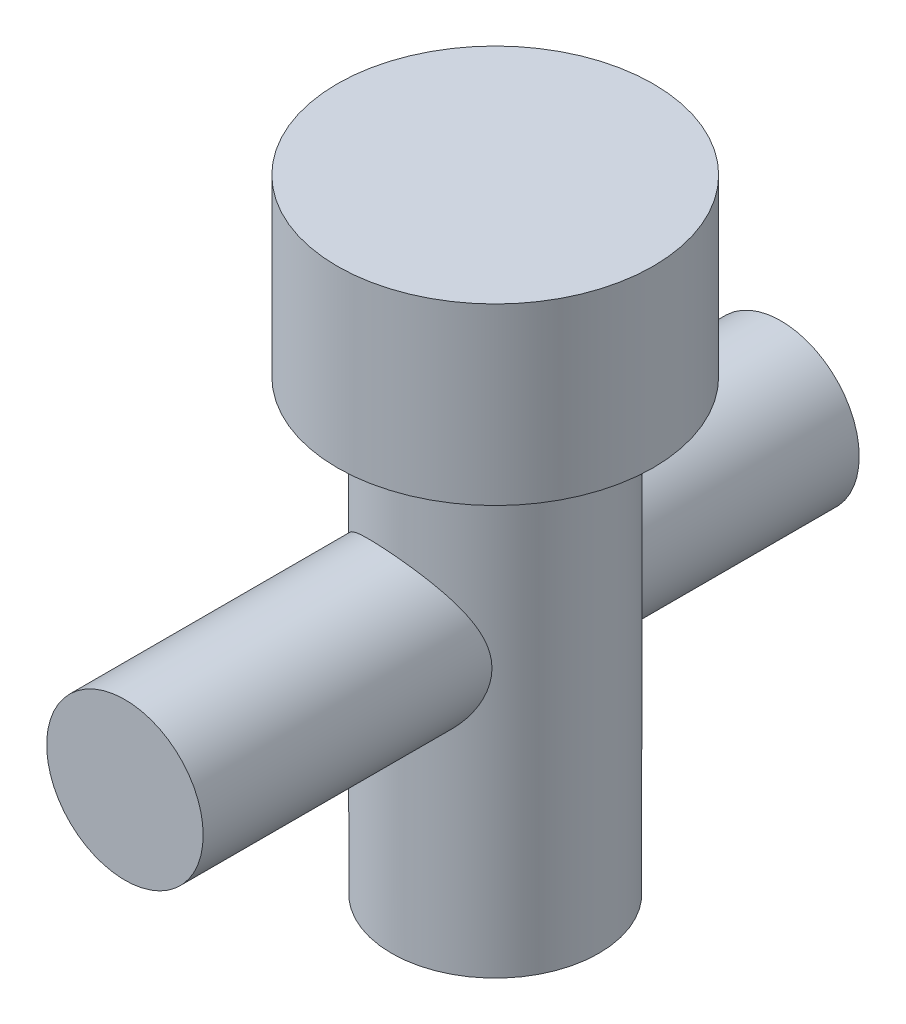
from build123d import *

# Parameters (mm, degrees)
SKIZZE1_W                       = 92.179109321
SKIZZE1_H                       = 76.63638805
LINEAR_AUSTRAGEN1_DEPTH         = 80.8
SKIZZE2_R                       = 19.459875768
SCHNITT_LINEAR_AUSTRAGEN1_DEPTH = 21.5
SKIZZE3_R                       = 12.773899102
SCHNITT_LINEAR_AUSTRAGEN2_DEPTH = 69
SKIZZE4_R                       = 9.639245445
SCHNITT_LINEAR_AUSTRAGEN3_DEPTH = 102.492633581
SKIZZE5_W                       = 92.179109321
SKIZZE5_H                       = 76.63638805
LINEAR_AUSTRAGEN2_DEPTH         = 80.8


with BuildPart() as part:
    # Skizze1 → Linear austragen1 (new body)
    with BuildSketch(Plane.XY):
        with Locations((-0.307776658, -1.923604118)):
            Rectangle(SKIZZE1_W, SKIZZE1_H)
    extrude(amount=LINEAR_AUSTRAGEN1_DEPTH)

    # Skizze2 → Schnitt-Linear austragen1 (cut)
    with BuildSketch(Plane(origin=(0, 36.394589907, 0), x_dir=(1, 0, 0), z_dir=(0, 1, 0))):
        with Locations(Location((-4.343969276, -35.997313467, 0), (0, 0, 270))):
            Circle(SKIZZE2_R)
    extrude(amount=-SCHNITT_LINEAR_AUSTRAGEN1_DEPTH, mode=Mode.SUBTRACT)

    # Skizze3 → Schnitt-Linear austragen2 (cut)
    with BuildSketch(Plane(origin=(0, 14.894589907, 0), x_dir=(1, 0, 0), z_dir=(0, 1, 0))):
        with Locations(Location((-4.343969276, -35.997313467, 0), (0, 0, 270))):
            Circle(SKIZZE3_R)
    extrude(amount=-SCHNITT_LINEAR_AUSTRAGEN2_DEPTH, mode=Mode.SUBTRACT)

    # Skizze4 → Schnitt-Linear austragen3 (cut, through all)
    with BuildSketch(Plane.XY.offset(80.8)):
        with Locations((-5.152753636, -7.19734012)):
            Circle(SKIZZE4_R)
    extrude(amount=-SCHNITT_LINEAR_AUSTRAGEN3_DEPTH, mode=Mode.SUBTRACT)


with BuildPart() as body_2:
    # Skizze5 → Linear austragen2 (new body)
    with BuildSketch(Plane.XY.offset(80.8)):
        with Locations((-0.307776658, -1.923604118)):
            Rectangle(SKIZZE5_W, SKIZZE5_H)
    extrude(amount=-LINEAR_AUSTRAGEN2_DEPTH)

    # Kombinieren2: cut part
    add(part.part, mode=Mode.SUBTRACT)


solid = body_2.part
